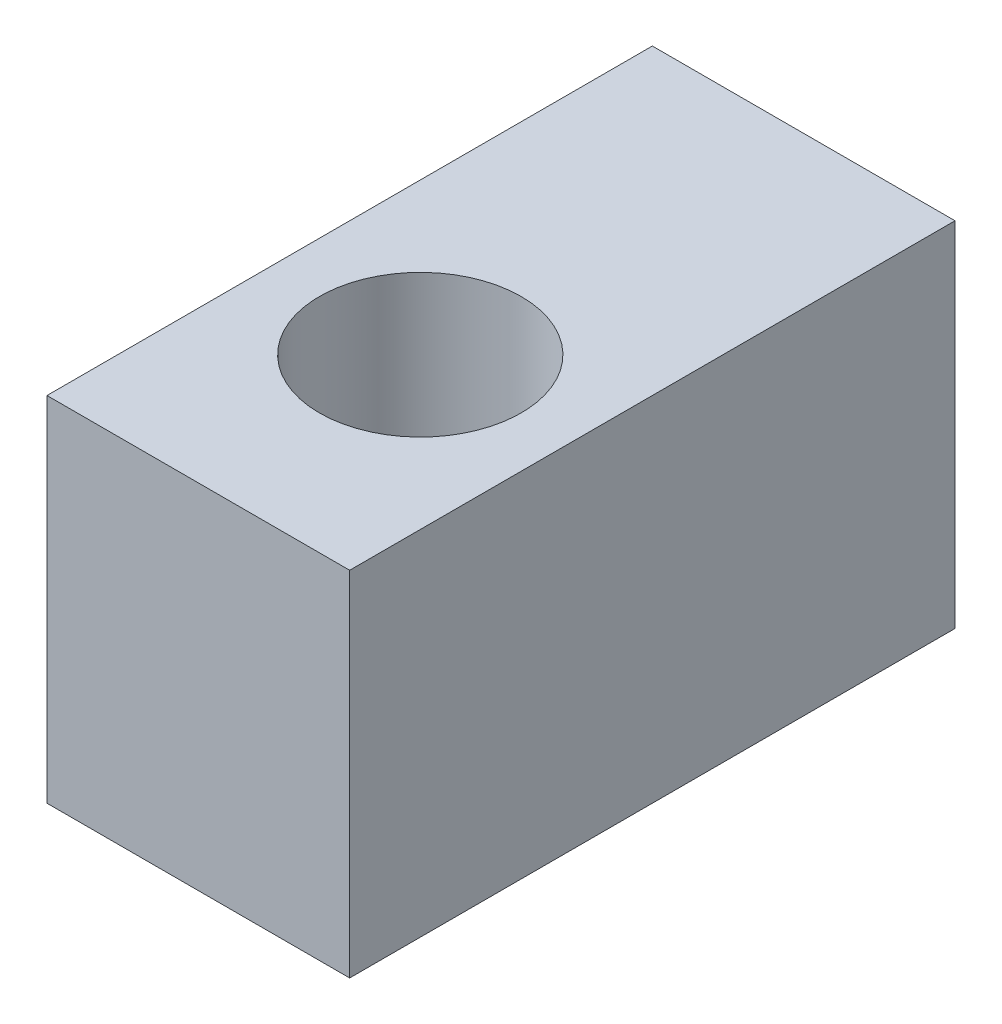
from build123d import *

# Parameters (mm, degrees)
SKETCH1_W           = 30
SKETCH1_H           = 35
BOSS_EXTRUDE1_DEPTH = 60
SKETCH2_R           = 10
CUT_EXTRUDE1_DEPTH  = 34


with BuildPart() as part:
    # Sketch1 → Boss-Extrude1 (new body)
    with BuildSketch(Plane.XY):
        with Locations((15, -17.5)):
            Rectangle(SKETCH1_W, SKETCH1_H)
    extrude(amount=BOSS_EXTRUDE1_DEPTH)

    # Sketch2 → Cut-Extrude1 (cut)
    with BuildSketch(Plane(origin=(0, 0, 0), x_dir=(1, 0, 0), z_dir=(0, 1, 0))):
        with Locations(Location((15, -38, 0), (0, 0, 270))):
            Circle(SKETCH2_R)
    extrude(amount=-CUT_EXTRUDE1_DEPTH, mode=Mode.SUBTRACT)


solid = part.part
